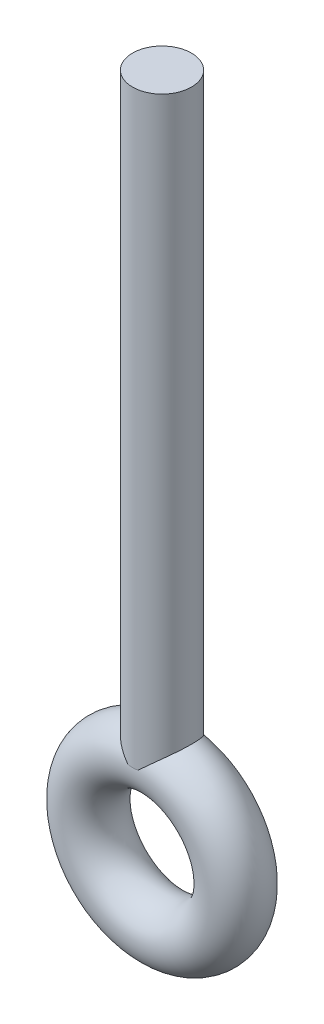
from build123d import *

# Parameters (mm, degrees)
SKETCH1_R           = 3
SKETCH2_R           = 3
BOSS_EXTRUDE1_DEPTH = 60


with BuildPart() as part:
    # Sketch1 → Revolve1 (revolve)
    with BuildSketch(Plane(origin=(0, 0, 0), x_dir=(1, 0, 0), z_dir=(0, 1, 0))):
        with Locations((-7.5, 0)):
            Circle(SKETCH1_R)
    revolve(axis=Axis((0, 0, -26.095080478), (0, 0, 1)))

    # Sketch2 → Boss-Extrude1 (add)
    with BuildSketch(Plane(origin=(0, 8, 0), x_dir=(1, 0, 0), z_dir=(0, 1, 0))):
        with Locations(Location((0, 0, 0), (0, 0, 99.917048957))):
            Circle(SKETCH2_R)
    extrude(amount=BOSS_EXTRUDE1_DEPTH)


solid = part.part
